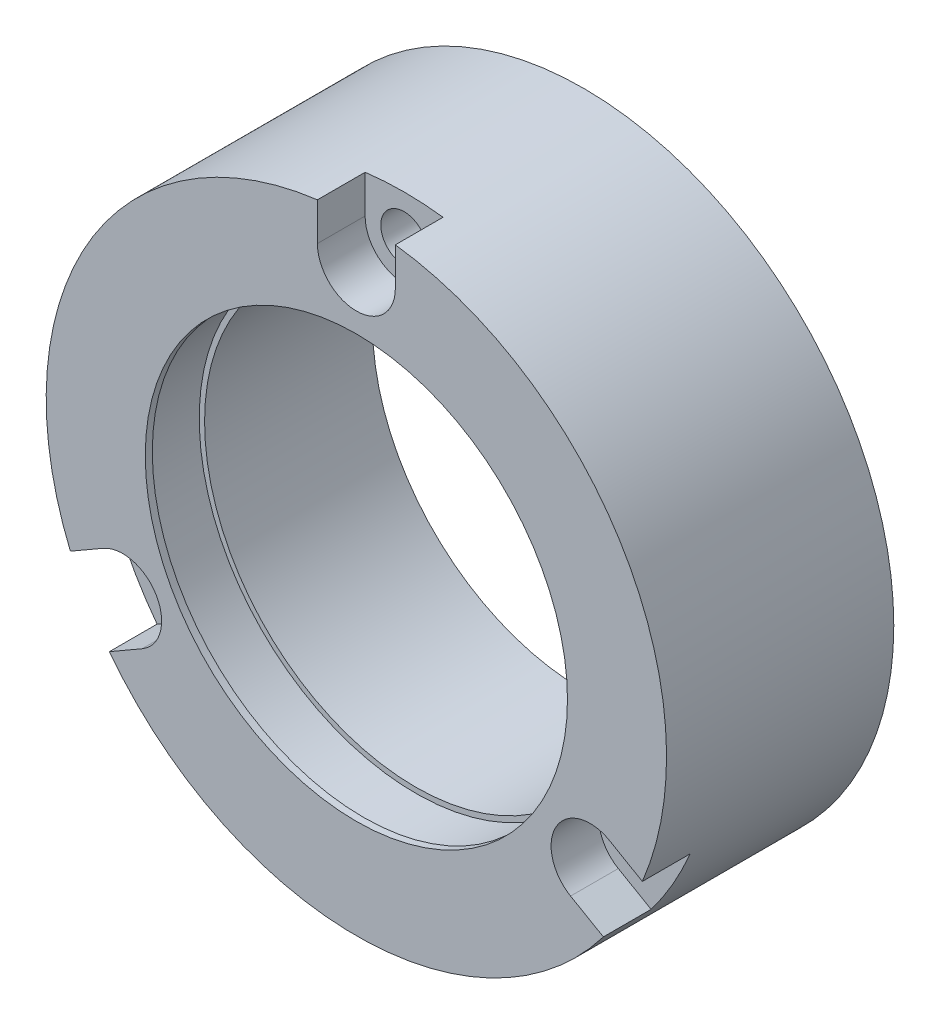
ISO-10303-21;
HEADER;
FILE_DESCRIPTION(('STEP AP214'),'2;1');
FILE_NAME('part.step','',(''),(''),'','','');
FILE_SCHEMA(('AUTOMOTIVE_DESIGN { 1 0 10303 214 1 1 1 1 }'));
ENDSEC;
DATA;
#1=APPLICATION_CONTEXT('core data for automotive mechanical design processes');
#2=APPLICATION_PROTOCOL_DEFINITION('international standard','automotive_design',2000,#1);
#3=PRODUCT_CONTEXT('',#1,'mechanical');
#4=PRODUCT('Part','Part','',(#3));
#5=PRODUCT_RELATED_PRODUCT_CATEGORY('part','',(#4));
#6=PRODUCT_DEFINITION_FORMATION('','',#4);
#7=PRODUCT_DEFINITION_CONTEXT('part definition',#1,'design');
#8=PRODUCT_DEFINITION('design','',#6,#7);
#9=PRODUCT_DEFINITION_SHAPE('','',#8);
#10=(LENGTH_UNIT() NAMED_UNIT(*) SI_UNIT(.MILLI.,.METRE.));
#11=(NAMED_UNIT(*) PLANE_ANGLE_UNIT() SI_UNIT($,.RADIAN.));
#12=(NAMED_UNIT(*) SI_UNIT($,.STERADIAN.) SOLID_ANGLE_UNIT());
#13=UNCERTAINTY_MEASURE_WITH_UNIT(LENGTH_MEASURE(1.E-05),#10,'distance_accuracy_value','');
#14=(GEOMETRIC_REPRESENTATION_CONTEXT(3) GLOBAL_UNCERTAINTY_ASSIGNED_CONTEXT((#13)) GLOBAL_UNIT_ASSIGNED_CONTEXT((#10,
#11,#12)) REPRESENTATION_CONTEXT('',''));
#15=CARTESIAN_POINT('',(0.,0.,0.));
#16=DIRECTION('',(0.,0.,1.));
#17=DIRECTION('',(1.,0.,0.));
#18=AXIS2_PLACEMENT_3D('',#15,#16,#17);
#19=CARTESIAN_POINT('',(0.,0.,0.));
#20=DIRECTION('',(0.,0.,1.));
#21=DIRECTION('',(1.,0.,0.));
#22=AXIS2_PLACEMENT_3D('',#19,#20,#21);
#23=PLANE('',#22);
#24=CARTESIAN_POINT('',(0.,0.,0.));
#25=DIRECTION('',(0.,0.,1.));
#26=DIRECTION('',(1.,0.,0.));
#27=AXIS2_PLACEMENT_3D('',#24,#25,#26);
#28=CIRCLE('',#27,23.5966);
#29=CARTESIAN_POINT('',(23.5966,0.,0.));
#30=VERTEX_POINT('',#29);
#31=EDGE_CURVE('E462',#30,#30,#28,.T.);
#32=ORIENTED_EDGE('',*,*,#31,.T.);
#33=EDGE_LOOP('',(#32));
#34=FACE_BOUND('',#33,.T.);
#35=CARTESIAN_POINT('',(0.,0.,0.));
#36=DIRECTION('',(0.,0.,-1.));
#37=DIRECTION('',(-1.,0.,0.));
#38=AXIS2_PLACEMENT_3D('',#35,#36,#37);
#39=CIRCLE('',#38,25.2603);
#40=CARTESIAN_POINT('',(-25.2603,0.,0.));
#41=VERTEX_POINT('',#40);
#42=EDGE_CURVE('E417',#41,#41,#39,.T.);
#43=ORIENTED_EDGE('',*,*,#42,.T.);
#44=EDGE_LOOP('',(#43));
#45=FACE_BOUND('',#44,.T.);
#46=ADVANCED_FACE('F15',(#34,#45),#23,.F.);
#47=CARTESIAN_POINT('',(0.,0.,25.4));
#48=DIRECTION('',(0.,0.,-1.));
#49=DIRECTION('',(-1.,0.,0.));
#50=AXIS2_PLACEMENT_3D('',#47,#48,#49);
#51=CYLINDRICAL_SURFACE('',#50,34.671);
#52=CARTESIAN_POINT('',(0.,0.,0.));
#53=DIRECTION('',(0.,0.,1.));
#54=DIRECTION('',(1.,0.,0.));
#55=AXIS2_PLACEMENT_3D('',#52,#53,#54);
#56=CIRCLE('',#55,34.671);
#57=CARTESIAN_POINT('',(34.671,0.,0.));
#58=VERTEX_POINT('',#57);
#59=EDGE_CURVE('E19',#58,#58,#56,.T.);
#60=ORIENTED_EDGE('',*,*,#59,.T.);
#61=EDGE_LOOP('',(#60));
#62=FACE_BOUND('',#61,.T.);
#63=DIRECTION('',(0.,0.,-1.));
#64=VECTOR('',#63,1.);
#65=CARTESIAN_POINT('',(27.6099840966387,-20.9706227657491,25.4));
#66=LINE('',#65,#64);
#67=CARTESIAN_POINT('',(27.6099840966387,-20.9706227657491,25.4));
#68=VERTEX_POINT('',#67);
#69=CARTESIAN_POINT('',(27.6099840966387,-20.9706227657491,20.066));
#70=VERTEX_POINT('',#69);
#71=EDGE_CURVE('E150',#68,#70,#66,.T.);
#72=ORIENTED_EDGE('',*,*,#71,.F.);
#73=CARTESIAN_POINT('',(0.,0.,25.4));
#74=DIRECTION('',(0.,0.,1.));
#75=DIRECTION('',(1.,0.,0.));
#76=AXIS2_PLACEMENT_3D('',#73,#74,#75);
#77=CIRCLE('',#76,34.671);
#78=CARTESIAN_POINT('',(-27.6099840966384,-20.9706227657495,25.4));
#79=VERTEX_POINT('',#78);
#80=EDGE_CURVE('E25',#79,#68,#77,.T.);
#81=ORIENTED_EDGE('',*,*,#80,.F.);
#82=DIRECTION('',(0.,0.,-1.));
#83=VECTOR('',#82,1.);
#84=CARTESIAN_POINT('',(-27.6099840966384,-20.9706227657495,25.4));
#85=LINE('',#84,#83);
#86=CARTESIAN_POINT('',(-27.6099840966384,-20.9706227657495,20.066));
#87=VERTEX_POINT('',#86);
#88=EDGE_CURVE('E313',#79,#87,#85,.T.);
#89=ORIENTED_EDGE('',*,*,#88,.T.);
#90=CARTESIAN_POINT('',(0.,0.,20.066));
#91=DIRECTION('',(0.,0.,1.));
#92=DIRECTION('',(-0.500000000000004,0.866025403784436,0.));
#93=AXIS2_PLACEMENT_3D('',#90,#91,#92);
#94=CIRCLE('',#93,34.671);
#95=CARTESIAN_POINT('',(-31.9660840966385,-13.4256362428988,20.066));
#96=VERTEX_POINT('',#95);
#97=EDGE_CURVE('E342',#96,#87,#94,.T.);
#98=ORIENTED_EDGE('',*,*,#97,.F.);
#99=DIRECTION('',(0.,0.,-1.));
#100=VECTOR('',#99,1.);
#101=CARTESIAN_POINT('',(-31.9660840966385,-13.4256362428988,25.4));
#102=LINE('',#101,#100);
#103=CARTESIAN_POINT('',(-31.9660840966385,-13.4256362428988,25.4));
#104=VERTEX_POINT('',#103);
#105=EDGE_CURVE('E176',#104,#96,#102,.T.);
#106=ORIENTED_EDGE('',*,*,#105,.F.);
#107=CARTESIAN_POINT('',(-4.35609999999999,34.396259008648,25.4));
#108=VERTEX_POINT('',#107);
#109=EDGE_CURVE('E10',#108,#104,#77,.T.);
#110=ORIENTED_EDGE('',*,*,#109,.F.);
#111=DIRECTION('',(0.,0.,-1.));
#112=VECTOR('',#111,1.);
#113=CARTESIAN_POINT('',(-4.35609999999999,34.396259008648,25.4));
#114=LINE('',#113,#112);
#115=CARTESIAN_POINT('',(-4.35609999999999,34.396259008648,20.066));
#116=VERTEX_POINT('',#115);
#117=EDGE_CURVE('E207',#108,#116,#114,.T.);
#118=ORIENTED_EDGE('',*,*,#117,.T.);
#119=CARTESIAN_POINT('',(0.,0.,20.066));
#120=DIRECTION('',(0.,0.,1.));
#121=DIRECTION('',(1.,0.,0.));
#122=AXIS2_PLACEMENT_3D('',#119,#120,#121);
#123=CIRCLE('',#122,34.671);
#124=CARTESIAN_POINT('',(4.35609999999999,34.396259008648,20.066));
#125=VERTEX_POINT('',#124);
#126=EDGE_CURVE('E199',#125,#116,#123,.T.);
#127=ORIENTED_EDGE('',*,*,#126,.F.);
#128=DIRECTION('',(0.,0.,-1.));
#129=VECTOR('',#128,1.);
#130=CARTESIAN_POINT('',(4.35609999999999,34.396259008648,25.4));
#131=LINE('',#130,#129);
#132=CARTESIAN_POINT('',(4.35609999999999,34.396259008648,25.4));
#133=VERTEX_POINT('',#132);
#134=EDGE_CURVE('E211',#133,#125,#131,.T.);
#135=ORIENTED_EDGE('',*,*,#134,.F.);
#136=CARTESIAN_POINT('',(31.9660840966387,-13.4256362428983,25.4));
#137=VERTEX_POINT('',#136);
#138=EDGE_CURVE('E26',#137,#133,#77,.T.);
#139=ORIENTED_EDGE('',*,*,#138,.F.);
#140=DIRECTION('',(0.,0.,-1.));
#141=VECTOR('',#140,1.);
#142=CARTESIAN_POINT('',(31.9660840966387,-13.4256362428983,25.4));
#143=LINE('',#142,#141);
#144=CARTESIAN_POINT('',(31.9660840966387,-13.4256362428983,20.066));
#145=VERTEX_POINT('',#144);
#146=EDGE_CURVE('E361',#137,#145,#143,.T.);
#147=ORIENTED_EDGE('',*,*,#146,.T.);
#148=CARTESIAN_POINT('',(0.,0.,20.066));
#149=DIRECTION('',(0.,0.,1.));
#150=DIRECTION('',(-0.499999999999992,-0.866025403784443,0.));
#151=AXIS2_PLACEMENT_3D('',#148,#149,#150);
#152=CIRCLE('',#151,34.671);
#153=EDGE_CURVE('E386',#70,#145,#152,.T.);
#154=ORIENTED_EDGE('',*,*,#153,.F.);
#155=EDGE_LOOP('',(#72,#81,#89,#98,#106,#110,#118,#127,#135,#139,#147,#154));
#156=FACE_BOUND('',#155,.T.);
#157=ADVANCED_FACE('F17',(#62,#156),#51,.T.);
#158=CARTESIAN_POINT('',(0.,0.,25.4));
#159=DIRECTION('',(0.,0.,1.));
#160=DIRECTION('',(1.,0.,0.));
#161=AXIS2_PLACEMENT_3D('',#158,#159,#160);
#162=PLANE('',#161);
#163=CARTESIAN_POINT('',(0.,0.,25.4));
#164=DIRECTION('',(0.,0.,1.));
#165=DIRECTION('',(1.,0.,0.));
#166=AXIS2_PLACEMENT_3D('',#163,#164,#165);
#167=CIRCLE('',#166,23.5966);
#168=CARTESIAN_POINT('',(23.5966,0.,25.4));
#169=VERTEX_POINT('',#168);
#170=EDGE_CURVE('E473',#169,#169,#167,.T.);
#171=ORIENTED_EDGE('',*,*,#170,.F.);
#172=EDGE_LOOP('',(#171));
#173=FACE_BOUND('',#172,.T.);
#174=ORIENTED_EDGE('',*,*,#80,.T.);
#175=DIRECTION('',(0.866025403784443,-0.499999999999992,0.));
#176=VECTOR('',#175,1.);
#177=CARTESIAN_POINT('',(27.6099840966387,-20.9706227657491,25.4));
#178=LINE('',#177,#176);
#179=CARTESIAN_POINT('',(23.9434412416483,-18.8537432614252,25.4));
#180=VERTEX_POINT('',#179);
#181=EDGE_CURVE('E141',#180,#68,#178,.T.);
#182=ORIENTED_EDGE('',*,*,#181,.F.);
#183=CARTESIAN_POINT('',(26.1214912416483,-15.0812499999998,25.4));
#184=DIRECTION('',(0.,0.,1.));
#185=DIRECTION('',(1.,0.,0.));
#186=AXIS2_PLACEMENT_3D('',#183,#184,#185);
#187=CIRCLE('',#186,4.35609999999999);
#188=CARTESIAN_POINT('',(28.2995412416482,-11.3087567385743,25.4));
#189=VERTEX_POINT('',#188);
#190=EDGE_CURVE('E157',#189,#180,#187,.T.);
#191=ORIENTED_EDGE('',*,*,#190,.F.);
#192=DIRECTION('',(-0.866025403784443,0.499999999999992,0.));
#193=VECTOR('',#192,1.);
#194=CARTESIAN_POINT('',(31.9660840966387,-13.4256362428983,25.4));
#195=LINE('',#194,#193);
#196=EDGE_CURVE('E161',#137,#189,#195,.T.);
#197=ORIENTED_EDGE('',*,*,#196,.F.);
#198=ORIENTED_EDGE('',*,*,#138,.T.);
#199=DIRECTION('',(0.,1.,0.));
#200=VECTOR('',#199,1.);
#201=CARTESIAN_POINT('',(4.35609999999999,34.396259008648,25.4));
#202=LINE('',#201,#200);
#203=CARTESIAN_POINT('',(4.3561,30.1625,25.4));
#204=VERTEX_POINT('',#203);
#205=EDGE_CURVE('E188',#204,#133,#202,.T.);
#206=ORIENTED_EDGE('',*,*,#205,.F.);
#207=CARTESIAN_POINT('',(0.,30.1625,25.4));
#208=DIRECTION('',(0.,0.,1.));
#209=DIRECTION('',(1.,0.,0.));
#210=AXIS2_PLACEMENT_3D('',#207,#208,#209);
#211=CIRCLE('',#210,4.35609999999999);
#212=CARTESIAN_POINT('',(-4.35609999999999,30.1625,25.4));
#213=VERTEX_POINT('',#212);
#214=EDGE_CURVE('E219',#213,#204,#211,.T.);
#215=ORIENTED_EDGE('',*,*,#214,.F.);
#216=DIRECTION('',(0.,-1.,0.));
#217=VECTOR('',#216,1.);
#218=CARTESIAN_POINT('',(-4.35609999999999,34.396259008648,25.4));
#219=LINE('',#218,#217);
#220=EDGE_CURVE('E192',#108,#213,#219,.T.);
#221=ORIENTED_EDGE('',*,*,#220,.F.);
#222=ORIENTED_EDGE('',*,*,#109,.T.);
#223=DIRECTION('',(-0.866025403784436,-0.500000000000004,0.));
#224=VECTOR('',#223,1.);
#225=CARTESIAN_POINT('',(-31.9660840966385,-13.4256362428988,25.4));
#226=LINE('',#225,#224);
#227=CARTESIAN_POINT('',(-28.2995412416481,-11.3087567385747,25.4));
#228=VERTEX_POINT('',#227);
#229=EDGE_CURVE('E330',#228,#104,#226,.T.);
#230=ORIENTED_EDGE('',*,*,#229,.F.);
#231=CARTESIAN_POINT('',(-26.1214912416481,-15.0812500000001,25.4));
#232=DIRECTION('',(0.,0.,1.));
#233=DIRECTION('',(1.,0.,0.));
#234=AXIS2_PLACEMENT_3D('',#231,#232,#233);
#235=CIRCLE('',#234,4.35609999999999);
#236=CARTESIAN_POINT('',(-23.943441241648,-18.8537432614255,25.4));
#237=VERTEX_POINT('',#236);
#238=EDGE_CURVE('E173',#237,#228,#235,.T.);
#239=ORIENTED_EDGE('',*,*,#238,.F.);
#240=DIRECTION('',(0.866025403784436,0.500000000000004,0.));
#241=VECTOR('',#240,1.);
#242=CARTESIAN_POINT('',(-27.6099840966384,-20.9706227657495,25.4));
#243=LINE('',#242,#241);
#244=EDGE_CURVE('E324',#79,#237,#243,.T.);
#245=ORIENTED_EDGE('',*,*,#244,.F.);
#246=EDGE_LOOP('',(#174,#182,#191,#197,#198,#206,#215,#221,#222,#230,#239,#245));
#247=FACE_BOUND('',#246,.T.);
#248=ADVANCED_FACE('F155',(#173,#247),#162,.T.);
#249=CARTESIAN_POINT('',(26.1214912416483,-15.0812499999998,0.));
#250=DIRECTION('',(0.,0.,1.));
#251=DIRECTION('',(1.,0.,0.));
#252=AXIS2_PLACEMENT_3D('',#249,#250,#251);
#253=CIRCLE('',#252,2.6035);
#254=CARTESIAN_POINT('',(28.7249912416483,-15.0812499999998,0.));
#255=VERTEX_POINT('',#254);
#256=EDGE_CURVE('E432',#255,#255,#253,.T.);
#257=ORIENTED_EDGE('',*,*,#256,.T.);
#258=EDGE_LOOP('',(#257));
#259=FACE_BOUND('',#258,.T.);
#260=CARTESIAN_POINT('',(-26.1214912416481,-15.0812500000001,0.));
#261=DIRECTION('',(0.,0.,1.));
#262=DIRECTION('',(1.,0.,0.));
#263=AXIS2_PLACEMENT_3D('',#260,#261,#262);
#264=CIRCLE('',#263,2.6035);
#265=CARTESIAN_POINT('',(-23.5179912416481,-15.0812500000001,0.));
#266=VERTEX_POINT('',#265);
#267=EDGE_CURVE('E431',#266,#266,#264,.T.);
#268=ORIENTED_EDGE('',*,*,#267,.T.);
#269=EDGE_LOOP('',(#268));
#270=FACE_BOUND('',#269,.T.);
#271=CARTESIAN_POINT('',(0.,30.1625,0.));
#272=DIRECTION('',(0.,0.,1.));
#273=DIRECTION('',(1.,0.,0.));
#274=AXIS2_PLACEMENT_3D('',#271,#272,#273);
#275=CIRCLE('',#274,2.6035);
#276=CARTESIAN_POINT('',(2.6035,30.1625,0.));
#277=VERTEX_POINT('',#276);
#278=EDGE_CURVE('E447',#277,#277,#275,.T.);
#279=ORIENTED_EDGE('',*,*,#278,.T.);
#280=EDGE_LOOP('',(#279));
#281=FACE_BOUND('',#280,.T.);
#282=CARTESIAN_POINT('',(0.,0.,0.));
#283=DIRECTION('',(0.,0.,-1.));
#284=DIRECTION('',(-1.,0.,0.));
#285=AXIS2_PLACEMENT_3D('',#282,#283,#284);
#286=CIRCLE('',#285,27.0383);
#287=CARTESIAN_POINT('',(-27.0383,0.,0.));
#288=VERTEX_POINT('',#287);
#289=EDGE_CURVE('E404',#288,#288,#286,.T.);
#290=ORIENTED_EDGE('',*,*,#289,.F.);
#291=EDGE_LOOP('',(#290));
#292=FACE_BOUND('',#291,.T.);
#293=ORIENTED_EDGE('',*,*,#59,.F.);
#294=EDGE_LOOP('',(#293));
#295=FACE_BOUND('',#294,.T.);
#296=ADVANCED_FACE('F669',(#259,#270,#281,#292,#295),#23,.F.);
#297=CARTESIAN_POINT('',(2.6035,30.1625,20.066));
#298=DIRECTION('',(0.,0.,-1.));
#299=DIRECTION('',(-1.,0.,0.));
#300=AXIS2_PLACEMENT_3D('',#297,#298,#299);
#301=PLANE('',#300);
#302=CARTESIAN_POINT('',(0.,30.1625,20.066));
#303=DIRECTION('',(0.,0.,1.));
#304=DIRECTION('',(1.,0.,0.));
#305=AXIS2_PLACEMENT_3D('',#302,#303,#304);
#306=CIRCLE('',#305,2.6035);
#307=CARTESIAN_POINT('',(2.6035,30.1625,20.066));
#308=VERTEX_POINT('',#307);
#309=EDGE_CURVE('E458',#308,#308,#306,.T.);
#310=ORIENTED_EDGE('',*,*,#309,.F.);
#311=EDGE_LOOP('',(#310));
#312=FACE_BOUND('',#311,.T.);
#313=CARTESIAN_POINT('',(0.,30.1625,20.066));
#314=DIRECTION('',(0.,0.,1.));
#315=DIRECTION('',(1.,0.,0.));
#316=AXIS2_PLACEMENT_3D('',#313,#314,#315);
#317=CIRCLE('',#316,4.3561);
#318=CARTESIAN_POINT('',(-4.3561,30.1625,20.066));
#319=VERTEX_POINT('',#318);
#320=CARTESIAN_POINT('',(4.3561,30.1625,20.066));
#321=VERTEX_POINT('',#320);
#322=EDGE_CURVE('E223',#319,#321,#317,.T.);
#323=ORIENTED_EDGE('',*,*,#322,.T.);
#324=DIRECTION('',(0.,1.,0.));
#325=VECTOR('',#324,1.);
#326=CARTESIAN_POINT('',(4.35609999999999,34.396259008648,20.066));
#327=LINE('',#326,#325);
#328=EDGE_CURVE('E187',#321,#125,#327,.T.);
#329=ORIENTED_EDGE('',*,*,#328,.T.);
#330=ORIENTED_EDGE('',*,*,#126,.T.);
#331=DIRECTION('',(0.,-1.,0.));
#332=VECTOR('',#331,1.);
#333=CARTESIAN_POINT('',(-4.35609999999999,34.396259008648,20.066));
#334=LINE('',#333,#332);
#335=EDGE_CURVE('E193',#116,#319,#334,.T.);
#336=ORIENTED_EDGE('',*,*,#335,.T.);
#337=EDGE_LOOP('',(#323,#329,#330,#336));
#338=FACE_BOUND('',#337,.T.);
#339=ADVANCED_FACE('F662',(#312,#338),#301,.F.);
#340=CARTESIAN_POINT('',(0.,30.1625,25.4));
#341=DIRECTION('',(0.,0.,1.));
#342=DIRECTION('',(1.,0.,0.));
#343=AXIS2_PLACEMENT_3D('',#340,#341,#342);
#344=CYLINDRICAL_SURFACE('',#343,4.3561);
#345=ORIENTED_EDGE('',*,*,#214,.T.);
#346=DIRECTION('',(0.,0.,-1.));
#347=VECTOR('',#346,1.);
#348=CARTESIAN_POINT('',(4.3561,30.1625,25.4));
#349=LINE('',#348,#347);
#350=EDGE_CURVE('E215',#204,#321,#349,.T.);
#351=ORIENTED_EDGE('',*,*,#350,.T.);
#352=ORIENTED_EDGE('',*,*,#322,.F.);
#353=DIRECTION('',(0.,0.,-1.));
#354=VECTOR('',#353,1.);
#355=CARTESIAN_POINT('',(-4.35609999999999,30.1625,25.4));
#356=LINE('',#355,#354);
#357=EDGE_CURVE('E196',#213,#319,#356,.T.);
#358=ORIENTED_EDGE('',*,*,#357,.F.);
#359=EDGE_LOOP('',(#345,#351,#352,#358));
#360=FACE_BOUND('',#359,.T.);
#361=ADVANCED_FACE('F668',(#360),#344,.F.);
#362=CARTESIAN_POINT('',(4.35609999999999,34.396259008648,25.4));
#363=DIRECTION('',(-1.,0.,0.));
#364=DIRECTION('',(0.,-1.,0.));
#365=AXIS2_PLACEMENT_3D('',#362,#363,#364);
#366=PLANE('',#365);
#367=ORIENTED_EDGE('',*,*,#328,.F.);
#368=ORIENTED_EDGE('',*,*,#350,.F.);
#369=ORIENTED_EDGE('',*,*,#205,.T.);
#370=ORIENTED_EDGE('',*,*,#134,.T.);
#371=EDGE_LOOP('',(#367,#368,#369,#370));
#372=FACE_BOUND('',#371,.T.);
#373=ADVANCED_FACE('F710',(#372),#366,.T.);
#374=CARTESIAN_POINT('',(-4.35609999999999,34.396259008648,25.4));
#375=DIRECTION('',(1.,0.,0.));
#376=DIRECTION('',(0.,1.,0.));
#377=AXIS2_PLACEMENT_3D('',#374,#375,#376);
#378=PLANE('',#377);
#379=ORIENTED_EDGE('',*,*,#335,.F.);
#380=ORIENTED_EDGE('',*,*,#117,.F.);
#381=ORIENTED_EDGE('',*,*,#220,.T.);
#382=ORIENTED_EDGE('',*,*,#357,.T.);
#383=EDGE_LOOP('',(#379,#380,#381,#382));
#384=FACE_BOUND('',#383,.T.);
#385=ADVANCED_FACE('F652',(#384),#378,.T.);
#386=CARTESIAN_POINT('',(-23.5179912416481,-15.0812500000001,20.066));
#387=DIRECTION('',(0.,0.,-1.));
#388=DIRECTION('',(-1.,0.,0.));
#389=AXIS2_PLACEMENT_3D('',#386,#387,#388);
#390=PLANE('',#389);
#391=CARTESIAN_POINT('',(-26.1214912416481,-15.0812500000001,20.066));
#392=DIRECTION('',(0.,0.,1.));
#393=DIRECTION('',(1.,0.,0.));
#394=AXIS2_PLACEMENT_3D('',#391,#392,#393);
#395=CIRCLE('',#394,2.6035);
#396=CARTESIAN_POINT('',(-23.5179912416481,-15.0812500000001,20.066));
#397=VERTEX_POINT('',#396);
#398=EDGE_CURVE('E443',#397,#397,#395,.T.);
#399=ORIENTED_EDGE('',*,*,#398,.F.);
#400=EDGE_LOOP('',(#399));
#401=FACE_BOUND('',#400,.T.);
#402=CARTESIAN_POINT('',(-26.1214912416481,-15.0812500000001,20.066));
#403=DIRECTION('',(0.,0.,1.));
#404=DIRECTION('',(1.,0.,0.));
#405=AXIS2_PLACEMENT_3D('',#402,#403,#404);
#406=CIRCLE('',#405,4.3561);
#407=CARTESIAN_POINT('',(-23.943441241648,-18.8537432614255,20.066));
#408=VERTEX_POINT('',#407);
#409=CARTESIAN_POINT('',(-28.2995412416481,-11.3087567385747,20.066));
#410=VERTEX_POINT('',#409);
#411=EDGE_CURVE('E183',#408,#410,#406,.T.);
#412=ORIENTED_EDGE('',*,*,#411,.T.);
#413=DIRECTION('',(-0.866025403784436,-0.500000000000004,0.));
#414=VECTOR('',#413,1.);
#415=CARTESIAN_POINT('',(-31.9660840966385,-13.4256362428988,20.066));
#416=LINE('',#415,#414);
#417=EDGE_CURVE('E149',#410,#96,#416,.T.);
#418=ORIENTED_EDGE('',*,*,#417,.T.);
#419=ORIENTED_EDGE('',*,*,#97,.T.);
#420=DIRECTION('',(0.866025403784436,0.500000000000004,0.));
#421=VECTOR('',#420,1.);
#422=CARTESIAN_POINT('',(-27.6099840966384,-20.9706227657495,20.066));
#423=LINE('',#422,#421);
#424=EDGE_CURVE('E336',#87,#408,#423,.T.);
#425=ORIENTED_EDGE('',*,*,#424,.T.);
#426=EDGE_LOOP('',(#412,#418,#419,#425));
#427=FACE_BOUND('',#426,.T.);
#428=ADVANCED_FACE('F646',(#401,#427),#390,.F.);
#429=CARTESIAN_POINT('',(-26.1214912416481,-15.0812500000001,25.4));
#430=DIRECTION('',(0.,0.,1.));
#431=DIRECTION('',(1.,0.,0.));
#432=AXIS2_PLACEMENT_3D('',#429,#430,#431);
#433=CYLINDRICAL_SURFACE('',#432,4.3561);
#434=ORIENTED_EDGE('',*,*,#238,.T.);
#435=DIRECTION('',(0.,0.,-1.));
#436=VECTOR('',#435,1.);
#437=CARTESIAN_POINT('',(-28.2995412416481,-11.3087567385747,25.4));
#438=LINE('',#437,#436);
#439=EDGE_CURVE('E167',#228,#410,#438,.T.);
#440=ORIENTED_EDGE('',*,*,#439,.T.);
#441=ORIENTED_EDGE('',*,*,#411,.F.);
#442=DIRECTION('',(0.,0.,-1.));
#443=VECTOR('',#442,1.);
#444=CARTESIAN_POINT('',(-23.943441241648,-18.8537432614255,25.4));
#445=LINE('',#444,#443);
#446=EDGE_CURVE('E48',#237,#408,#445,.T.);
#447=ORIENTED_EDGE('',*,*,#446,.F.);
#448=EDGE_LOOP('',(#434,#440,#441,#447));
#449=FACE_BOUND('',#448,.T.);
#450=ADVANCED_FACE('F637',(#449),#433,.F.);
#451=CARTESIAN_POINT('',(28.7249912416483,-15.0812499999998,20.066));
#452=DIRECTION('',(0.,0.,-1.));
#453=DIRECTION('',(-1.,0.,0.));
#454=AXIS2_PLACEMENT_3D('',#451,#452,#453);
#455=PLANE('',#454);
#456=CARTESIAN_POINT('',(26.1214912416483,-15.0812499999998,20.066));
#457=DIRECTION('',(0.,0.,1.));
#458=DIRECTION('',(1.,0.,0.));
#459=AXIS2_PLACEMENT_3D('',#456,#457,#458);
#460=CIRCLE('',#459,2.6035);
#461=CARTESIAN_POINT('',(28.7249912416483,-15.0812499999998,20.066));
#462=VERTEX_POINT('',#461);
#463=EDGE_CURVE('E427',#462,#462,#460,.T.);
#464=ORIENTED_EDGE('',*,*,#463,.F.);
#465=EDGE_LOOP('',(#464));
#466=FACE_BOUND('',#465,.T.);
#467=CARTESIAN_POINT('',(26.1214912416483,-15.0812499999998,20.066));
#468=DIRECTION('',(0.,0.,1.));
#469=DIRECTION('',(1.,0.,0.));
#470=AXIS2_PLACEMENT_3D('',#467,#468,#469);
#471=CIRCLE('',#470,4.35609999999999);
#472=CARTESIAN_POINT('',(28.2995412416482,-11.3087567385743,20.066));
#473=VERTEX_POINT('',#472);
#474=CARTESIAN_POINT('',(23.9434412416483,-18.8537432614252,20.066));
#475=VERTEX_POINT('',#474);
#476=EDGE_CURVE('E166',#473,#475,#471,.T.);
#477=ORIENTED_EDGE('',*,*,#476,.T.);
#478=DIRECTION('',(0.866025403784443,-0.499999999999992,0.));
#479=VECTOR('',#478,1.);
#480=CARTESIAN_POINT('',(27.6099840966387,-20.9706227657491,20.066));
#481=LINE('',#480,#479);
#482=EDGE_CURVE('E143',#475,#70,#481,.T.);
#483=ORIENTED_EDGE('',*,*,#482,.T.);
#484=ORIENTED_EDGE('',*,*,#153,.T.);
#485=DIRECTION('',(-0.866025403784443,0.499999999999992,0.));
#486=VECTOR('',#485,1.);
#487=CARTESIAN_POINT('',(31.9660840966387,-13.4256362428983,20.066));
#488=LINE('',#487,#486);
#489=EDGE_CURVE('E162',#145,#473,#488,.T.);
#490=ORIENTED_EDGE('',*,*,#489,.T.);
#491=EDGE_LOOP('',(#477,#483,#484,#490));
#492=FACE_BOUND('',#491,.T.);
#493=ADVANCED_FACE('F632',(#466,#492),#455,.F.);
#494=CARTESIAN_POINT('',(26.1214912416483,-15.0812499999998,25.4));
#495=DIRECTION('',(0.,0.,1.));
#496=DIRECTION('',(1.,0.,0.));
#497=AXIS2_PLACEMENT_3D('',#494,#495,#496);
#498=CYLINDRICAL_SURFACE('',#497,4.35609999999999);
#499=ORIENTED_EDGE('',*,*,#190,.T.);
#500=DIRECTION('',(0.,0.,-1.));
#501=VECTOR('',#500,1.);
#502=CARTESIAN_POINT('',(23.9434412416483,-18.8537432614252,25.4));
#503=LINE('',#502,#501);
#504=EDGE_CURVE('E137',#180,#475,#503,.T.);
#505=ORIENTED_EDGE('',*,*,#504,.T.);
#506=ORIENTED_EDGE('',*,*,#476,.F.);
#507=DIRECTION('',(0.,0.,-1.));
#508=VECTOR('',#507,1.);
#509=CARTESIAN_POINT('',(28.2995412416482,-11.3087567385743,25.4));
#510=LINE('',#509,#508);
#511=EDGE_CURVE('E38',#189,#473,#510,.T.);
#512=ORIENTED_EDGE('',*,*,#511,.F.);
#513=EDGE_LOOP('',(#499,#505,#506,#512));
#514=FACE_BOUND('',#513,.T.);
#515=ADVANCED_FACE('F164',(#514),#498,.F.);
#516=CARTESIAN_POINT('',(-31.9660840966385,-13.4256362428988,25.4));
#517=DIRECTION('',(0.500000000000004,-0.866025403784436,0.));
#518=DIRECTION('',(0.866025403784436,0.500000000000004,0.));
#519=AXIS2_PLACEMENT_3D('',#516,#517,#518);
#520=PLANE('',#519);
#521=ORIENTED_EDGE('',*,*,#417,.F.);
#522=ORIENTED_EDGE('',*,*,#439,.F.);
#523=ORIENTED_EDGE('',*,*,#229,.T.);
#524=ORIENTED_EDGE('',*,*,#105,.T.);
#525=EDGE_LOOP('',(#521,#522,#523,#524));
#526=FACE_BOUND('',#525,.T.);
#527=ADVANCED_FACE('F751',(#526),#520,.T.);
#528=CARTESIAN_POINT('',(-27.6099840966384,-20.9706227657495,25.4));
#529=DIRECTION('',(-0.500000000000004,0.866025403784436,0.));
#530=DIRECTION('',(-0.866025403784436,-0.500000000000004,0.));
#531=AXIS2_PLACEMENT_3D('',#528,#529,#530);
#532=PLANE('',#531);
#533=ORIENTED_EDGE('',*,*,#424,.F.);
#534=ORIENTED_EDGE('',*,*,#88,.F.);
#535=ORIENTED_EDGE('',*,*,#244,.T.);
#536=ORIENTED_EDGE('',*,*,#446,.T.);
#537=EDGE_LOOP('',(#533,#534,#535,#536));
#538=FACE_BOUND('',#537,.T.);
#539=ADVANCED_FACE('F761',(#538),#532,.T.);
#540=CARTESIAN_POINT('',(27.6099840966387,-20.9706227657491,25.4));
#541=DIRECTION('',(0.499999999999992,0.866025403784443,0.));
#542=DIRECTION('',(-0.866025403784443,0.499999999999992,0.));
#543=AXIS2_PLACEMENT_3D('',#540,#541,#542);
#544=PLANE('',#543);
#545=ORIENTED_EDGE('',*,*,#482,.F.);
#546=ORIENTED_EDGE('',*,*,#504,.F.);
#547=ORIENTED_EDGE('',*,*,#181,.T.);
#548=ORIENTED_EDGE('',*,*,#71,.T.);
#549=EDGE_LOOP('',(#545,#546,#547,#548));
#550=FACE_BOUND('',#549,.T.);
#551=ADVANCED_FACE('F139',(#550),#544,.T.);
#552=CARTESIAN_POINT('',(31.9660840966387,-13.4256362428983,25.4));
#553=DIRECTION('',(-0.499999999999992,-0.866025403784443,0.));
#554=DIRECTION('',(0.866025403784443,-0.499999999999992,0.));
#555=AXIS2_PLACEMENT_3D('',#552,#553,#554);
#556=PLANE('',#555);
#557=ORIENTED_EDGE('',*,*,#489,.F.);
#558=ORIENTED_EDGE('',*,*,#146,.F.);
#559=ORIENTED_EDGE('',*,*,#196,.T.);
#560=ORIENTED_EDGE('',*,*,#511,.T.);
#561=EDGE_LOOP('',(#557,#558,#559,#560));
#562=FACE_BOUND('',#561,.T.);
#563=ADVANCED_FACE('F781',(#562),#556,.T.);
#564=CARTESIAN_POINT('',(0.,0.,1.651));
#565=DIRECTION('',(0.,0.,-1.));
#566=DIRECTION('',(-1.,0.,0.));
#567=AXIS2_PLACEMENT_3D('',#564,#565,#566);
#568=CYLINDRICAL_SURFACE('',#567,27.0383);
#569=CARTESIAN_POINT('',(0.,0.,1.651));
#570=DIRECTION('',(0.,0.,-1.));
#571=DIRECTION('',(-1.,0.,0.));
#572=AXIS2_PLACEMENT_3D('',#569,#570,#571);
#573=CIRCLE('',#572,27.0383);
#574=CARTESIAN_POINT('',(-27.0383,0.,1.651));
#575=VERTEX_POINT('',#574);
#576=EDGE_CURVE('E397',#575,#575,#573,.T.);
#577=CARTESIAN_POINT('',(-27.0383,0.,1.651));
#578=CARTESIAN_POINT('',(-27.0383,0.,1.63380208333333));
#579=CARTESIAN_POINT('',(-27.0383,0.,1.61660416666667));
#580=CARTESIAN_POINT('',(-27.0383,0.,1.58220833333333));
#581=CARTESIAN_POINT('',(-27.0383,0.,1.56501041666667));
#582=CARTESIAN_POINT('',(-27.0383,0.,1.53061458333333));
#583=CARTESIAN_POINT('',(-27.0383,0.,1.51341666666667));
#584=CARTESIAN_POINT('',(-27.0383,0.,1.47902083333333));
#585=CARTESIAN_POINT('',(-27.0383,0.,1.46182291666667));
#586=CARTESIAN_POINT('',(-27.0383,0.,1.42742708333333));
#587=CARTESIAN_POINT('',(-27.0383,0.,1.41022916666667));
#588=CARTESIAN_POINT('',(-27.0383,0.,1.37583333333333));
#589=CARTESIAN_POINT('',(-27.0383,0.,1.35863541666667));
#590=CARTESIAN_POINT('',(-27.0383,0.,1.32423958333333));
#591=CARTESIAN_POINT('',(-27.0383,0.,1.30704166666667));
#592=CARTESIAN_POINT('',(-27.0383,0.,1.27264583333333));
#593=CARTESIAN_POINT('',(-27.0383,0.,1.25544791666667));
#594=CARTESIAN_POINT('',(-27.0383,0.,1.22105208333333));
#595=CARTESIAN_POINT('',(-27.0383,0.,1.20385416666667));
#596=CARTESIAN_POINT('',(-27.0383,0.,1.16945833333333));
#597=CARTESIAN_POINT('',(-27.0383,0.,1.15226041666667));
#598=CARTESIAN_POINT('',(-27.0383,0.,1.11786458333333));
#599=CARTESIAN_POINT('',(-27.0383,0.,1.10066666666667));
#600=CARTESIAN_POINT('',(-27.0383,0.,1.06627083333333));
#601=CARTESIAN_POINT('',(-27.0383,0.,1.04907291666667));
#602=CARTESIAN_POINT('',(-27.0383,0.,1.01467708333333));
#603=CARTESIAN_POINT('',(-27.0383,0.,0.997479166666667));
#604=CARTESIAN_POINT('',(-27.0383,0.,0.963083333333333));
#605=CARTESIAN_POINT('',(-27.0383,0.,0.945885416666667));
#606=CARTESIAN_POINT('',(-27.0383,0.,0.911489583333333));
#607=CARTESIAN_POINT('',(-27.0383,0.,0.894291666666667));
#608=CARTESIAN_POINT('',(-27.0383,0.,0.859895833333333));
#609=CARTESIAN_POINT('',(-27.0383,0.,0.842697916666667));
#610=CARTESIAN_POINT('',(-27.0383,0.,0.808302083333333));
#611=CARTESIAN_POINT('',(-27.0383,0.,0.791104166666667));
#612=CARTESIAN_POINT('',(-27.0383,0.,0.756708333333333));
#613=CARTESIAN_POINT('',(-27.0383,0.,0.739510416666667));
#614=CARTESIAN_POINT('',(-27.0383,0.,0.705114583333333));
#615=CARTESIAN_POINT('',(-27.0383,0.,0.687916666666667));
#616=CARTESIAN_POINT('',(-27.0383,0.,0.653520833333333));
#617=CARTESIAN_POINT('',(-27.0383,0.,0.636322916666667));
#618=CARTESIAN_POINT('',(-27.0383,0.,0.601927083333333));
#619=CARTESIAN_POINT('',(-27.0383,0.,0.584729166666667));
#620=CARTESIAN_POINT('',(-27.0383,0.,0.550333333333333));
#621=CARTESIAN_POINT('',(-27.0383,0.,0.533135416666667));
#622=CARTESIAN_POINT('',(-27.0383,0.,0.498739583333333));
#623=CARTESIAN_POINT('',(-27.0383,0.,0.481541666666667));
#624=CARTESIAN_POINT('',(-27.0383,0.,0.447145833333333));
#625=CARTESIAN_POINT('',(-27.0383,0.,0.429947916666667));
#626=CARTESIAN_POINT('',(-27.0383,0.,0.395552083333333));
#627=CARTESIAN_POINT('',(-27.0383,0.,0.378354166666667));
#628=CARTESIAN_POINT('',(-27.0383,0.,0.343958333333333));
#629=CARTESIAN_POINT('',(-27.0383,0.,0.326760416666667));
#630=CARTESIAN_POINT('',(-27.0383,0.,0.292364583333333));
#631=CARTESIAN_POINT('',(-27.0383,0.,0.275166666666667));
#632=CARTESIAN_POINT('',(-27.0383,0.,0.240770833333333));
#633=CARTESIAN_POINT('',(-27.0383,0.,0.223572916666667));
#634=CARTESIAN_POINT('',(-27.0383,0.,0.189177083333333));
#635=CARTESIAN_POINT('',(-27.0383,0.,0.171979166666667));
#636=CARTESIAN_POINT('',(-27.0383,0.,0.137583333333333));
#637=CARTESIAN_POINT('',(-27.0383,0.,0.120385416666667));
#638=CARTESIAN_POINT('',(-27.0383,0.,0.0859895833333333));
#639=CARTESIAN_POINT('',(-27.0383,0.,0.0687916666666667));
#640=CARTESIAN_POINT('',(-27.0383,0.,0.0343958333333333));
#641=CARTESIAN_POINT('',(-27.0383,0.,0.0171979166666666));
#642=CARTESIAN_POINT('',(-27.0383,0.,0.));
#643=B_SPLINE_CURVE_WITH_KNOTS('',3,(#577,#578,#579,#580,#581,#582,#583,#584,#585,#586,#587,
#588,#589,#590,#591,#592,#593,#594,#595,#596,#597,#598,#599,#600,#601,#602,#603,#604,#605,#606,
#607,#608,#609,#610,#611,#612,#613,#614,#615,#616,#617,#618,#619,#620,#621,#622,#623,#624,#625,
#626,#627,#628,#629,#630,#631,#632,#633,#634,#635,#636,#637,#638,#639,#640,#641,#642),
.UNSPECIFIED.,.F.,.F.,(4,2,2,2,2,2,2,2,2,2,2,2,2,2,2,2,2,2,2,2,2,2,2,2,2,2,2,2,2,2,2,2,4),(0.,
0.05159375,0.1031875,0.15478125,0.206375,0.25796875,0.3095625,0.36115625,0.41275,0.46434375,
0.5159375,0.56753125,0.619125,0.67071875,0.7223125,0.77390625,0.8255,0.87709375,0.9286875,
0.98028125,1.031875,1.08346875,1.1350625,1.18665625,1.23825,1.28984375,1.3414375,1.39303125,
1.444625,1.49621875,1.5478125,1.59940625,1.651),.UNSPECIFIED.);
#644=EDGE_CURVE('BSEAM791',#575,#288,#643,.T.);
#645=ORIENTED_EDGE('',*,*,#576,.F.);
#646=ORIENTED_EDGE('',*,*,#289,.T.);
#647=ORIENTED_EDGE('',*,*,#644,.T.);
#648=ORIENTED_EDGE('',*,*,#644,.F.);
#649=EDGE_LOOP('',(#645,#647,#646,#648));
#650=FACE_BOUND('',#649,.T.);
#651=ADVANCED_FACE('F791',(#650),#568,.F.);
#652=CARTESIAN_POINT('',(0.,0.,1.651));
#653=DIRECTION('',(0.,0.,-1.));
#654=DIRECTION('',(-1.,0.,0.));
#655=AXIS2_PLACEMENT_3D('',#652,#653,#654);
#656=PLANE('',#655);
#657=CARTESIAN_POINT('',(0.,0.,1.651));
#658=DIRECTION('',(0.,0.,-1.));
#659=DIRECTION('',(-1.,0.,0.));
#660=AXIS2_PLACEMENT_3D('',#657,#658,#659);
#661=CIRCLE('',#660,25.2603);
#662=CARTESIAN_POINT('',(-25.2603,0.,1.651));
#663=VERTEX_POINT('',#662);
#664=EDGE_CURVE('E411',#663,#663,#661,.T.);
#665=ORIENTED_EDGE('',*,*,#664,.F.);
#666=EDGE_LOOP('',(#665));
#667=FACE_BOUND('',#666,.T.);
#668=ORIENTED_EDGE('',*,*,#576,.T.);
#669=EDGE_LOOP('',(#668));
#670=FACE_BOUND('',#669,.T.);
#671=ADVANCED_FACE('F801',(#667,#670),#656,.T.);
#672=CARTESIAN_POINT('',(0.,0.,1.651));
#673=DIRECTION('',(0.,0.,-1.));
#674=DIRECTION('',(-1.,0.,0.));
#675=AXIS2_PLACEMENT_3D('',#672,#673,#674);
#676=CYLINDRICAL_SURFACE('',#675,25.2603);
#677=CARTESIAN_POINT('',(-25.2603,0.,1.651));
#678=CARTESIAN_POINT('',(-25.2603,0.,1.63380208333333));
#679=CARTESIAN_POINT('',(-25.2603,0.,1.61660416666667));
#680=CARTESIAN_POINT('',(-25.2603,0.,1.58220833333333));
#681=CARTESIAN_POINT('',(-25.2603,0.,1.56501041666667));
#682=CARTESIAN_POINT('',(-25.2603,0.,1.53061458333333));
#683=CARTESIAN_POINT('',(-25.2603,0.,1.51341666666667));
#684=CARTESIAN_POINT('',(-25.2603,0.,1.47902083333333));
#685=CARTESIAN_POINT('',(-25.2603,0.,1.46182291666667));
#686=CARTESIAN_POINT('',(-25.2603,0.,1.42742708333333));
#687=CARTESIAN_POINT('',(-25.2603,0.,1.41022916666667));
#688=CARTESIAN_POINT('',(-25.2603,0.,1.37583333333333));
#689=CARTESIAN_POINT('',(-25.2603,0.,1.35863541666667));
#690=CARTESIAN_POINT('',(-25.2603,0.,1.32423958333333));
#691=CARTESIAN_POINT('',(-25.2603,0.,1.30704166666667));
#692=CARTESIAN_POINT('',(-25.2603,0.,1.27264583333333));
#693=CARTESIAN_POINT('',(-25.2603,0.,1.25544791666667));
#694=CARTESIAN_POINT('',(-25.2603,0.,1.22105208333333));
#695=CARTESIAN_POINT('',(-25.2603,0.,1.20385416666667));
#696=CARTESIAN_POINT('',(-25.2603,0.,1.16945833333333));
#697=CARTESIAN_POINT('',(-25.2603,0.,1.15226041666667));
#698=CARTESIAN_POINT('',(-25.2603,0.,1.11786458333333));
#699=CARTESIAN_POINT('',(-25.2603,0.,1.10066666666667));
#700=CARTESIAN_POINT('',(-25.2603,0.,1.06627083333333));
#701=CARTESIAN_POINT('',(-25.2603,0.,1.04907291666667));
#702=CARTESIAN_POINT('',(-25.2603,0.,1.01467708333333));
#703=CARTESIAN_POINT('',(-25.2603,0.,0.997479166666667));
#704=CARTESIAN_POINT('',(-25.2603,0.,0.963083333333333));
#705=CARTESIAN_POINT('',(-25.2603,0.,0.945885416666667));
#706=CARTESIAN_POINT('',(-25.2603,0.,0.911489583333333));
#707=CARTESIAN_POINT('',(-25.2603,0.,0.894291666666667));
#708=CARTESIAN_POINT('',(-25.2603,0.,0.859895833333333));
#709=CARTESIAN_POINT('',(-25.2603,0.,0.842697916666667));
#710=CARTESIAN_POINT('',(-25.2603,0.,0.808302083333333));
#711=CARTESIAN_POINT('',(-25.2603,0.,0.791104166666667));
#712=CARTESIAN_POINT('',(-25.2603,0.,0.756708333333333));
#713=CARTESIAN_POINT('',(-25.2603,0.,0.739510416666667));
#714=CARTESIAN_POINT('',(-25.2603,0.,0.705114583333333));
#715=CARTESIAN_POINT('',(-25.2603,0.,0.687916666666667));
#716=CARTESIAN_POINT('',(-25.2603,0.,0.653520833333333));
#717=CARTESIAN_POINT('',(-25.2603,0.,0.636322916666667));
#718=CARTESIAN_POINT('',(-25.2603,0.,0.601927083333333));
#719=CARTESIAN_POINT('',(-25.2603,0.,0.584729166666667));
#720=CARTESIAN_POINT('',(-25.2603,0.,0.550333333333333));
#721=CARTESIAN_POINT('',(-25.2603,0.,0.533135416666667));
#722=CARTESIAN_POINT('',(-25.2603,0.,0.498739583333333));
#723=CARTESIAN_POINT('',(-25.2603,0.,0.481541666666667));
#724=CARTESIAN_POINT('',(-25.2603,0.,0.447145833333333));
#725=CARTESIAN_POINT('',(-25.2603,0.,0.429947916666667));
#726=CARTESIAN_POINT('',(-25.2603,0.,0.395552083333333));
#727=CARTESIAN_POINT('',(-25.2603,0.,0.378354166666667));
#728=CARTESIAN_POINT('',(-25.2603,0.,0.343958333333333));
#729=CARTESIAN_POINT('',(-25.2603,0.,0.326760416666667));
#730=CARTESIAN_POINT('',(-25.2603,0.,0.292364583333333));
#731=CARTESIAN_POINT('',(-25.2603,0.,0.275166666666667));
#732=CARTESIAN_POINT('',(-25.2603,0.,0.240770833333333));
#733=CARTESIAN_POINT('',(-25.2603,0.,0.223572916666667));
#734=CARTESIAN_POINT('',(-25.2603,0.,0.189177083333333));
#735=CARTESIAN_POINT('',(-25.2603,0.,0.171979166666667));
#736=CARTESIAN_POINT('',(-25.2603,0.,0.137583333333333));
#737=CARTESIAN_POINT('',(-25.2603,0.,0.120385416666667));
#738=CARTESIAN_POINT('',(-25.2603,0.,0.0859895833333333));
#739=CARTESIAN_POINT('',(-25.2603,0.,0.0687916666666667));
#740=CARTESIAN_POINT('',(-25.2603,0.,0.0343958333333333));
#741=CARTESIAN_POINT('',(-25.2603,0.,0.0171979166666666));
#742=CARTESIAN_POINT('',(-25.2603,0.,0.));
#743=B_SPLINE_CURVE_WITH_KNOTS('',3,(#677,#678,#679,#680,#681,#682,#683,#684,#685,#686,#687,
#688,#689,#690,#691,#692,#693,#694,#695,#696,#697,#698,#699,#700,#701,#702,#703,#704,#705,#706,
#707,#708,#709,#710,#711,#712,#713,#714,#715,#716,#717,#718,#719,#720,#721,#722,#723,#724,#725,
#726,#727,#728,#729,#730,#731,#732,#733,#734,#735,#736,#737,#738,#739,#740,#741,#742),
.UNSPECIFIED.,.F.,.F.,(4,2,2,2,2,2,2,2,2,2,2,2,2,2,2,2,2,2,2,2,2,2,2,2,2,2,2,2,2,2,2,2,4),(0.,
0.05159375,0.1031875,0.15478125,0.206375,0.25796875,0.3095625,0.36115625,0.41275,0.46434375,
0.5159375,0.56753125,0.619125,0.67071875,0.7223125,0.77390625,0.8255,0.87709375,0.9286875,
0.98028125,1.031875,1.08346875,1.1350625,1.18665625,1.23825,1.28984375,1.3414375,1.39303125,
1.444625,1.49621875,1.5478125,1.59940625,1.651),.UNSPECIFIED.);
#744=EDGE_CURVE('BSEAM252',#663,#41,#743,.T.);
#745=ORIENTED_EDGE('',*,*,#664,.T.);
#746=ORIENTED_EDGE('',*,*,#42,.F.);
#747=ORIENTED_EDGE('',*,*,#744,.T.);
#748=ORIENTED_EDGE('',*,*,#744,.F.);
#749=EDGE_LOOP('',(#745,#747,#746,#748));
#750=FACE_BOUND('',#749,.T.);
#751=ADVANCED_FACE('F252',(#750),#676,.T.);
#752=CARTESIAN_POINT('',(26.1214912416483,-15.0812499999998,25.4));
#753=DIRECTION('',(0.,0.,1.));
#754=DIRECTION('',(1.,0.,0.));
#755=AXIS2_PLACEMENT_3D('',#752,#753,#754);
#756=CYLINDRICAL_SURFACE('',#755,2.6035);
#757=ORIENTED_EDGE('',*,*,#256,.F.);
#758=EDGE_LOOP('',(#757));
#759=FACE_BOUND('',#758,.T.);
#760=ORIENTED_EDGE('',*,*,#463,.T.);
#761=EDGE_LOOP('',(#760));
#762=FACE_BOUND('',#761,.T.);
#763=ADVANCED_FACE('F614',(#759,#762),#756,.F.);
#764=CARTESIAN_POINT('',(-26.1214912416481,-15.0812500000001,25.4));
#765=DIRECTION('',(0.,0.,1.));
#766=DIRECTION('',(1.,0.,0.));
#767=AXIS2_PLACEMENT_3D('',#764,#765,#766);
#768=CYLINDRICAL_SURFACE('',#767,2.6035);
#769=ORIENTED_EDGE('',*,*,#267,.F.);
#770=EDGE_LOOP('',(#769));
#771=FACE_BOUND('',#770,.T.);
#772=ORIENTED_EDGE('',*,*,#398,.T.);
#773=EDGE_LOOP('',(#772));
#774=FACE_BOUND('',#773,.T.);
#775=ADVANCED_FACE('F601',(#771,#774),#768,.F.);
#776=CARTESIAN_POINT('',(0.,30.1625,25.4));
#777=DIRECTION('',(0.,0.,1.));
#778=DIRECTION('',(1.,0.,0.));
#779=AXIS2_PLACEMENT_3D('',#776,#777,#778);
#780=CYLINDRICAL_SURFACE('',#779,2.6035);
#781=ORIENTED_EDGE('',*,*,#278,.F.);
#782=EDGE_LOOP('',(#781));
#783=FACE_BOUND('',#782,.T.);
#784=ORIENTED_EDGE('',*,*,#309,.T.);
#785=EDGE_LOOP('',(#784));
#786=FACE_BOUND('',#785,.T.);
#787=ADVANCED_FACE('F515',(#783,#786),#780,.F.);
#788=CARTESIAN_POINT('',(0.,0.,0.));
#789=DIRECTION('',(0.,0.,1.));
#790=DIRECTION('',(1.,0.,0.));
#791=AXIS2_PLACEMENT_3D('',#788,#789,#790);
#792=CYLINDRICAL_SURFACE('',#791,23.5966);
#793=CARTESIAN_POINT('',(0.,0.,24.6126));
#794=DIRECTION('',(0.,0.,1.));
#795=DIRECTION('',(1.,0.,0.));
#796=AXIS2_PLACEMENT_3D('',#793,#794,#795);
#797=CIRCLE('',#796,23.5966);
#798=CARTESIAN_POINT('',(23.5966,0.,24.6126));
#799=VERTEX_POINT('',#798);
#800=EDGE_CURVE('E423',#799,#799,#797,.F.);
#801=ORIENTED_EDGE('',*,*,#800,.T.);
#802=EDGE_LOOP('',(#801));
#803=FACE_BOUND('',#802,.T.);
#804=ORIENTED_EDGE('',*,*,#170,.T.);
#805=EDGE_LOOP('',(#804));
#806=FACE_BOUND('',#805,.T.);
#807=ADVANCED_FACE('F508',(#803,#806),#792,.F.);
#808=CARTESIAN_POINT('',(0.,0.,24.6126));
#809=DIRECTION('',(0.,0.,1.));
#810=DIRECTION('',(1.,0.,0.));
#811=AXIS2_PLACEMENT_3D('',#808,#809,#810);
#812=PLANE('',#811);
#813=CARTESIAN_POINT('',(0.,0.,24.6126));
#814=DIRECTION('',(0.,0.,1.));
#815=DIRECTION('',(1.,0.,0.));
#816=AXIS2_PLACEMENT_3D('',#813,#814,#815);
#817=CIRCLE('',#816,24.1935);
#818=CARTESIAN_POINT('',(24.1935,0.,24.6126));
#819=VERTEX_POINT('',#818);
#820=EDGE_CURVE('E482',#819,#819,#817,.T.);
#821=ORIENTED_EDGE('',*,*,#820,.F.);
#822=EDGE_LOOP('',(#821));
#823=FACE_BOUND('',#822,.T.);
#824=ORIENTED_EDGE('',*,*,#800,.F.);
#825=EDGE_LOOP('',(#824));
#826=FACE_BOUND('',#825,.T.);
#827=ADVANCED_FACE('F514',(#823,#826),#812,.F.);
#828=CARTESIAN_POINT('',(0.,0.,18.7706));
#829=DIRECTION('',(0.,0.,1.));
#830=DIRECTION('',(1.,0.,0.));
#831=AXIS2_PLACEMENT_3D('',#828,#829,#830);
#832=CYLINDRICAL_SURFACE('',#831,24.1935);
#833=CARTESIAN_POINT('',(0.,0.,18.7706));
#834=DIRECTION('',(0.,0.,1.));
#835=DIRECTION('',(1.,0.,0.));
#836=AXIS2_PLACEMENT_3D('',#833,#834,#835);
#837=CIRCLE('',#836,24.1935);
#838=CARTESIAN_POINT('',(24.1935,0.,18.7706));
#839=VERTEX_POINT('',#838);
#840=EDGE_CURVE('E485',#839,#839,#837,.T.);
#841=ORIENTED_EDGE('',*,*,#840,.F.);
#842=EDGE_LOOP('',(#841));
#843=FACE_BOUND('',#842,.T.);
#844=ORIENTED_EDGE('',*,*,#820,.T.);
#845=EDGE_LOOP('',(#844));
#846=FACE_BOUND('',#845,.T.);
#847=ADVANCED_FACE('F531',(#843,#846),#832,.F.);
#848=CARTESIAN_POINT('',(0.,0.,18.7706));
#849=DIRECTION('',(0.,0.,1.));
#850=DIRECTION('',(1.,0.,0.));
#851=AXIS2_PLACEMENT_3D('',#848,#849,#850);
#852=PLANE('',#851);
#853=ORIENTED_EDGE('',*,*,#840,.T.);
#854=EDGE_LOOP('',(#853));
#855=FACE_BOUND('',#854,.T.);
#856=CARTESIAN_POINT('',(0.,0.,18.7706));
#857=DIRECTION('',(0.,0.,1.));
#858=DIRECTION('',(1.,0.,0.));
#859=AXIS2_PLACEMENT_3D('',#856,#857,#858);
#860=CIRCLE('',#859,23.5966);
#861=CARTESIAN_POINT('',(23.5966,0.,18.7706));
#862=VERTEX_POINT('',#861);
#863=EDGE_CURVE('E477',#862,#862,#860,.F.);
#864=ORIENTED_EDGE('',*,*,#863,.T.);
#865=EDGE_LOOP('',(#864));
#866=FACE_BOUND('',#865,.T.);
#867=ADVANCED_FACE('F542',(#855,#866),#852,.T.);
#868=ORIENTED_EDGE('',*,*,#31,.F.);
#869=EDGE_LOOP('',(#868));
#870=FACE_BOUND('',#869,.T.);
#871=ORIENTED_EDGE('',*,*,#863,.F.);
#872=EDGE_LOOP('',(#871));
#873=FACE_BOUND('',#872,.T.);
#874=ADVANCED_FACE('F518',(#870,#873),#792,.F.);
#875=CLOSED_SHELL('',(#46,#157,#248,#296,#339,#361,#373,#385,#428,#450,#493,#515,#527,#539,#551,
#563,#651,#671,#751,#763,#775,#787,#807,#827,#847,#867,#874));
#876=MANIFOLD_SOLID_BREP('B1',#875);
#877=ADVANCED_BREP_SHAPE_REPRESENTATION('',(#18,#876),#14);
#878=SHAPE_DEFINITION_REPRESENTATION(#9,#877);
ENDSEC;
END-ISO-10303-21;
